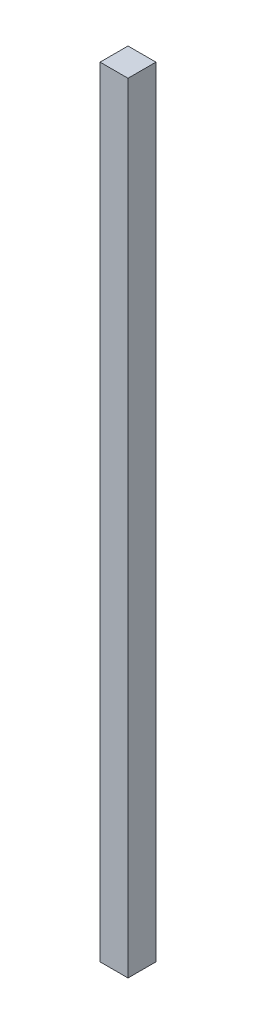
from build123d import *

# Parameters (mm, degrees)
ESQUISSE1_W      = 24
ESQUISSE1_H      = 670
EXTRUSION1_DEPTH = 24


with BuildPart() as part:
    # Esquisse1 → Extrusion1 (new body)
    with BuildSketch(Plane.XY):
        with Locations((12, 335)):
            Rectangle(ESQUISSE1_W, ESQUISSE1_H)
    extrude(amount=EXTRUSION1_DEPTH)


solid = part.part
